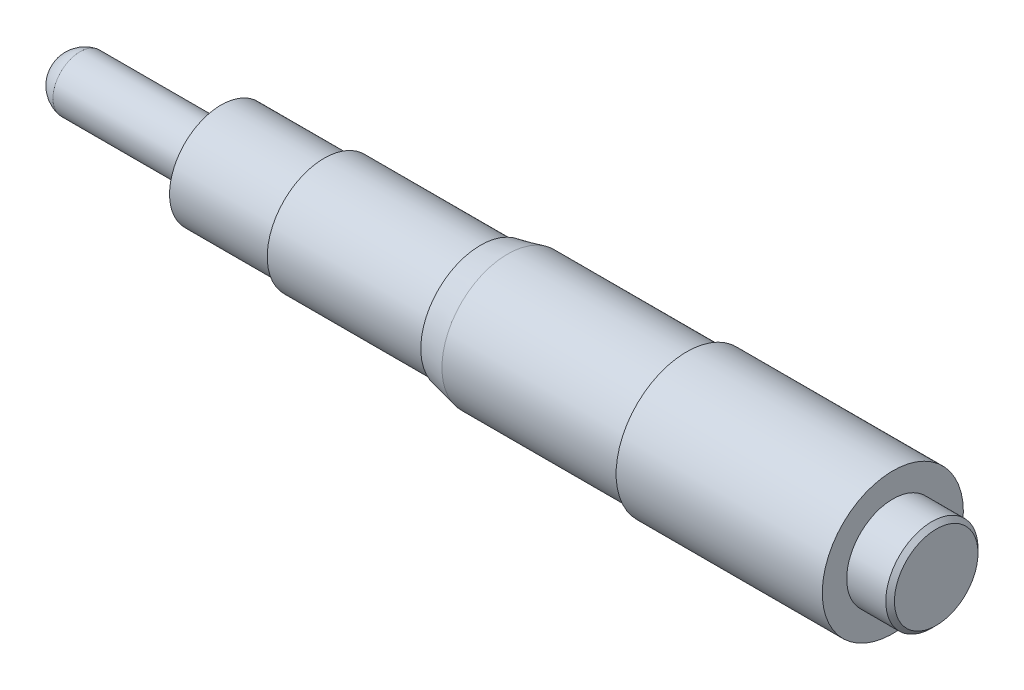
ISO-10303-21;
HEADER;
FILE_DESCRIPTION(('STEP AP214'),'2;1');
FILE_NAME('part.step','',(''),(''),'','','');
FILE_SCHEMA(('AUTOMOTIVE_DESIGN { 1 0 10303 214 1 1 1 1 }'));
ENDSEC;
DATA;
#1=APPLICATION_CONTEXT('core data for automotive mechanical design processes');
#2=APPLICATION_PROTOCOL_DEFINITION('international standard','automotive_design',2000,#1);
#3=PRODUCT_CONTEXT('',#1,'mechanical');
#4=PRODUCT('Part','Part','',(#3));
#5=PRODUCT_RELATED_PRODUCT_CATEGORY('part','',(#4));
#6=PRODUCT_DEFINITION_FORMATION('','',#4);
#7=PRODUCT_DEFINITION_CONTEXT('part definition',#1,'design');
#8=PRODUCT_DEFINITION('design','',#6,#7);
#9=PRODUCT_DEFINITION_SHAPE('','',#8);
#10=(LENGTH_UNIT() NAMED_UNIT(*) SI_UNIT(.MILLI.,.METRE.));
#11=(NAMED_UNIT(*) PLANE_ANGLE_UNIT() SI_UNIT($,.RADIAN.));
#12=(NAMED_UNIT(*) SI_UNIT($,.STERADIAN.) SOLID_ANGLE_UNIT());
#13=UNCERTAINTY_MEASURE_WITH_UNIT(LENGTH_MEASURE(1.E-05),#10,'distance_accuracy_value','');
#14=(GEOMETRIC_REPRESENTATION_CONTEXT(3) GLOBAL_UNCERTAINTY_ASSIGNED_CONTEXT((#13)) GLOBAL_UNIT_ASSIGNED_CONTEXT((#10,
#11,#12)) REPRESENTATION_CONTEXT('',''));
#15=CARTESIAN_POINT('',(0.,0.,0.));
#16=DIRECTION('',(0.,0.,1.));
#17=DIRECTION('',(1.,0.,0.));
#18=AXIS2_PLACEMENT_3D('',#15,#16,#17);
#19=CARTESIAN_POINT('',(-22.0619047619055,6.83589469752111E-13,0.));
#20=DIRECTION('',(1.,0.,0.));
#21=DIRECTION('',(0.,1.,0.));
#22=AXIS2_PLACEMENT_3D('',#19,#20,#21);
#23=SPHERICAL_SURFACE('',#22,2.53809523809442);
#24=CARTESIAN_POINT('',(-22.5,0.,0.));
#25=DIRECTION('',(1.,0.,0.));
#26=DIRECTION('',(0.,0.,-1.));
#27=AXIS2_PLACEMENT_3D('',#24,#25,#26);
#28=CIRCLE('',#27,2.5);
#29=CARTESIAN_POINT('',(-22.5,0.,-2.5));
#30=VERTEX_POINT('',#29);
#31=EDGE_CURVE('E5',#30,#30,#28,.T.);
#32=ORIENTED_EDGE('',*,*,#31,.F.);
#33=EDGE_LOOP('',(#32));
#34=FACE_BOUND('',#33,.T.);
#35=ADVANCED_FACE('F9',(#34),#23,.T.);
#36=CARTESIAN_POINT('',(56.4,0.,0.));
#37=DIRECTION('',(1.,0.,0.));
#38=DIRECTION('',(0.,0.,-1.));
#39=AXIS2_PLACEMENT_3D('',#36,#37,#38);
#40=CYLINDRICAL_SURFACE('',#39,2.5);
#41=CARTESIAN_POINT('',(-9.50000000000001,0.,0.));
#42=DIRECTION('',(1.,0.,0.));
#43=DIRECTION('',(0.,0.,-1.));
#44=AXIS2_PLACEMENT_3D('',#41,#42,#43);
#45=CIRCLE('',#44,2.5);
#46=CARTESIAN_POINT('',(-9.50000000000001,0.,-2.5));
#47=VERTEX_POINT('',#46);
#48=EDGE_CURVE('E20',#47,#47,#45,.T.);
#49=ORIENTED_EDGE('',*,*,#48,.F.);
#50=EDGE_LOOP('',(#49));
#51=FACE_BOUND('',#50,.T.);
#52=ORIENTED_EDGE('',*,*,#31,.T.);
#53=EDGE_LOOP('',(#52));
#54=FACE_BOUND('',#53,.T.);
#55=ADVANCED_FACE('F26',(#51,#54),#40,.T.);
#56=CARTESIAN_POINT('',(-9.5,2.5,0.));
#57=DIRECTION('',(1.,0.,0.));
#58=DIRECTION('',(0.,0.,-1.));
#59=AXIS2_PLACEMENT_3D('',#56,#57,#58);
#60=PLANE('',#59);
#61=CARTESIAN_POINT('',(-9.50000000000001,0.,0.));
#62=DIRECTION('',(1.,0.,0.));
#63=DIRECTION('',(0.,0.,-1.));
#64=AXIS2_PLACEMENT_3D('',#61,#62,#63);
#65=CIRCLE('',#64,4.75);
#66=CARTESIAN_POINT('',(-9.50000000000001,0.,-4.75));
#67=VERTEX_POINT('',#66);
#68=EDGE_CURVE('E33',#67,#67,#65,.T.);
#69=ORIENTED_EDGE('',*,*,#68,.F.);
#70=EDGE_LOOP('',(#69));
#71=FACE_BOUND('',#70,.T.);
#72=ORIENTED_EDGE('',*,*,#48,.T.);
#73=EDGE_LOOP('',(#72));
#74=FACE_BOUND('',#73,.T.);
#75=ADVANCED_FACE('F39',(#71,#74),#60,.F.);
#76=CARTESIAN_POINT('',(56.4,0.,0.));
#77=DIRECTION('',(1.,0.,0.));
#78=DIRECTION('',(0.,0.,-1.));
#79=AXIS2_PLACEMENT_3D('',#76,#77,#78);
#80=CYLINDRICAL_SURFACE('',#79,4.75);
#81=CARTESIAN_POINT('',(0.,0.,0.));
#82=DIRECTION('',(1.,0.,0.));
#83=DIRECTION('',(0.,0.,-1.));
#84=AXIS2_PLACEMENT_3D('',#81,#82,#83);
#85=CIRCLE('',#84,4.75);
#86=CARTESIAN_POINT('',(0.,0.,-4.75));
#87=VERTEX_POINT('',#86);
#88=EDGE_CURVE('E46',#87,#87,#85,.T.);
#89=ORIENTED_EDGE('',*,*,#88,.F.);
#90=EDGE_LOOP('',(#89));
#91=FACE_BOUND('',#90,.T.);
#92=ORIENTED_EDGE('',*,*,#68,.T.);
#93=EDGE_LOOP('',(#92));
#94=FACE_BOUND('',#93,.T.);
#95=ADVANCED_FACE('F52',(#91,#94),#80,.T.);
#96=CARTESIAN_POINT('',(0.,4.75,0.));
#97=DIRECTION('',(1.,0.,0.));
#98=DIRECTION('',(0.,0.,-1.));
#99=AXIS2_PLACEMENT_3D('',#96,#97,#98);
#100=PLANE('',#99);
#101=CARTESIAN_POINT('',(0.,0.,0.));
#102=DIRECTION('',(1.,0.,0.));
#103=DIRECTION('',(0.,0.,-1.));
#104=AXIS2_PLACEMENT_3D('',#101,#102,#103);
#105=CIRCLE('',#104,5.25);
#106=CARTESIAN_POINT('',(0.,0.,-5.25));
#107=VERTEX_POINT('',#106);
#108=EDGE_CURVE('E59',#107,#107,#105,.T.);
#109=ORIENTED_EDGE('',*,*,#108,.F.);
#110=EDGE_LOOP('',(#109));
#111=FACE_BOUND('',#110,.T.);
#112=ORIENTED_EDGE('',*,*,#88,.T.);
#113=EDGE_LOOP('',(#112));
#114=FACE_BOUND('',#113,.T.);
#115=ADVANCED_FACE('F65',(#111,#114),#100,.F.);
#116=CARTESIAN_POINT('',(56.4,0.,0.));
#117=DIRECTION('',(1.,0.,0.));
#118=DIRECTION('',(0.,0.,-1.));
#119=AXIS2_PLACEMENT_3D('',#116,#117,#118);
#120=CYLINDRICAL_SURFACE('',#119,5.25);
#121=CARTESIAN_POINT('',(14.4,0.,0.));
#122=DIRECTION('',(1.,0.,0.));
#123=DIRECTION('',(0.,0.,-1.));
#124=AXIS2_PLACEMENT_3D('',#121,#122,#123);
#125=CIRCLE('',#124,5.25);
#126=CARTESIAN_POINT('',(14.4,0.,-5.25));
#127=VERTEX_POINT('',#126);
#128=EDGE_CURVE('E72',#127,#127,#125,.T.);
#129=ORIENTED_EDGE('',*,*,#128,.F.);
#130=EDGE_LOOP('',(#129));
#131=FACE_BOUND('',#130,.T.);
#132=ORIENTED_EDGE('',*,*,#108,.T.);
#133=EDGE_LOOP('',(#132));
#134=FACE_BOUND('',#133,.T.);
#135=ADVANCED_FACE('F78',(#131,#134),#120,.T.);
#136=CARTESIAN_POINT('',(14.4,5.25,0.));
#137=DIRECTION('',(1.,0.,0.));
#138=DIRECTION('',(0.,0.,-1.));
#139=AXIS2_PLACEMENT_3D('',#136,#137,#138);
#140=PLANE('',#139);
#141=CARTESIAN_POINT('',(14.4,0.,0.));
#142=DIRECTION('',(1.,0.,0.));
#143=DIRECTION('',(0.,0.,-1.));
#144=AXIS2_PLACEMENT_3D('',#141,#142,#143);
#145=CIRCLE('',#144,5.5);
#146=CARTESIAN_POINT('',(14.4,0.,-5.5));
#147=VERTEX_POINT('',#146);
#148=EDGE_CURVE('E85',#147,#147,#145,.T.);
#149=ORIENTED_EDGE('',*,*,#148,.F.);
#150=EDGE_LOOP('',(#149));
#151=FACE_BOUND('',#150,.T.);
#152=ORIENTED_EDGE('',*,*,#128,.T.);
#153=EDGE_LOOP('',(#152));
#154=FACE_BOUND('',#153,.T.);
#155=ADVANCED_FACE('F91',(#151,#154),#140,.F.);
#156=CARTESIAN_POINT('',(14.4,0.,0.));
#157=DIRECTION('',(1.,0.,0.));
#158=DIRECTION('',(0.,0.,-1.));
#159=AXIS2_PLACEMENT_3D('',#156,#157,#158);
#160=CONICAL_SURFACE('',#159,5.5,0.216550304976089);
#161=CARTESIAN_POINT('',(16.9,0.,0.));
#162=DIRECTION('',(1.,0.,0.));
#163=DIRECTION('',(0.,0.,-1.));
#164=AXIS2_PLACEMENT_3D('',#161,#162,#163);
#165=CIRCLE('',#164,6.05);
#166=CARTESIAN_POINT('',(16.9,0.,-6.05));
#167=VERTEX_POINT('',#166);
#168=EDGE_CURVE('E98',#167,#167,#165,.T.);
#169=ORIENTED_EDGE('',*,*,#168,.F.);
#170=EDGE_LOOP('',(#169));
#171=FACE_BOUND('',#170,.T.);
#172=ORIENTED_EDGE('',*,*,#148,.T.);
#173=EDGE_LOOP('',(#172));
#174=FACE_BOUND('',#173,.T.);
#175=ADVANCED_FACE('F104',(#171,#174),#160,.T.);
#176=CARTESIAN_POINT('',(56.4,0.,0.));
#177=DIRECTION('',(1.,0.,0.));
#178=DIRECTION('',(0.,0.,-1.));
#179=AXIS2_PLACEMENT_3D('',#176,#177,#178);
#180=CYLINDRICAL_SURFACE('',#179,6.05);
#181=CARTESIAN_POINT('',(33.4,0.,0.));
#182=DIRECTION('',(1.,0.,0.));
#183=DIRECTION('',(0.,0.,-1.));
#184=AXIS2_PLACEMENT_3D('',#181,#182,#183);
#185=CIRCLE('',#184,6.05);
#186=CARTESIAN_POINT('',(33.4,0.,-6.05));
#187=VERTEX_POINT('',#186);
#188=EDGE_CURVE('E111',#187,#187,#185,.T.);
#189=ORIENTED_EDGE('',*,*,#188,.F.);
#190=EDGE_LOOP('',(#189));
#191=FACE_BOUND('',#190,.T.);
#192=ORIENTED_EDGE('',*,*,#168,.T.);
#193=EDGE_LOOP('',(#192));
#194=FACE_BOUND('',#193,.T.);
#195=ADVANCED_FACE('F117',(#191,#194),#180,.T.);
#196=CARTESIAN_POINT('',(33.4,6.05,0.));
#197=DIRECTION('',(1.,0.,0.));
#198=DIRECTION('',(0.,0.,-1.));
#199=AXIS2_PLACEMENT_3D('',#196,#197,#198);
#200=PLANE('',#199);
#201=CARTESIAN_POINT('',(33.4,0.,0.));
#202=DIRECTION('',(1.,0.,0.));
#203=DIRECTION('',(0.,0.,-1.));
#204=AXIS2_PLACEMENT_3D('',#201,#202,#203);
#205=CIRCLE('',#204,6.5);
#206=CARTESIAN_POINT('',(33.4,0.,-6.5));
#207=VERTEX_POINT('',#206);
#208=EDGE_CURVE('E124',#207,#207,#205,.T.);
#209=ORIENTED_EDGE('',*,*,#208,.F.);
#210=EDGE_LOOP('',(#209));
#211=FACE_BOUND('',#210,.T.);
#212=ORIENTED_EDGE('',*,*,#188,.T.);
#213=EDGE_LOOP('',(#212));
#214=FACE_BOUND('',#213,.T.);
#215=ADVANCED_FACE('F130',(#211,#214),#200,.F.);
#216=CARTESIAN_POINT('',(56.4,0.,0.));
#217=DIRECTION('',(1.,0.,0.));
#218=DIRECTION('',(0.,0.,-1.));
#219=AXIS2_PLACEMENT_3D('',#216,#217,#218);
#220=CYLINDRICAL_SURFACE('',#219,6.5);
#221=CARTESIAN_POINT('',(52.4,0.,0.));
#222=DIRECTION('',(1.,0.,0.));
#223=DIRECTION('',(0.,0.,-1.));
#224=AXIS2_PLACEMENT_3D('',#221,#222,#223);
#225=CIRCLE('',#224,6.5);
#226=CARTESIAN_POINT('',(52.4,0.,-6.5));
#227=VERTEX_POINT('',#226);
#228=EDGE_CURVE('E137',#227,#227,#225,.T.);
#229=ORIENTED_EDGE('',*,*,#228,.F.);
#230=EDGE_LOOP('',(#229));
#231=FACE_BOUND('',#230,.T.);
#232=ORIENTED_EDGE('',*,*,#208,.T.);
#233=EDGE_LOOP('',(#232));
#234=FACE_BOUND('',#233,.T.);
#235=ADVANCED_FACE('F143',(#231,#234),#220,.T.);
#236=CARTESIAN_POINT('',(52.4,6.5,0.));
#237=DIRECTION('',(-1.,0.,0.));
#238=DIRECTION('',(0.,0.,1.));
#239=AXIS2_PLACEMENT_3D('',#236,#237,#238);
#240=PLANE('',#239);
#241=CARTESIAN_POINT('',(52.4,0.,0.));
#242=DIRECTION('',(1.,0.,0.));
#243=DIRECTION('',(0.,0.,-1.));
#244=AXIS2_PLACEMENT_3D('',#241,#242,#243);
#245=CIRCLE('',#244,4.25);
#246=CARTESIAN_POINT('',(52.4,0.,-4.25));
#247=VERTEX_POINT('',#246);
#248=EDGE_CURVE('E150',#247,#247,#245,.T.);
#249=ORIENTED_EDGE('',*,*,#248,.F.);
#250=EDGE_LOOP('',(#249));
#251=FACE_BOUND('',#250,.T.);
#252=ORIENTED_EDGE('',*,*,#228,.T.);
#253=EDGE_LOOP('',(#252));
#254=FACE_BOUND('',#253,.T.);
#255=ADVANCED_FACE('F156',(#251,#254),#240,.F.);
#256=CARTESIAN_POINT('',(56.4,0.,0.));
#257=DIRECTION('',(1.,0.,0.));
#258=DIRECTION('',(0.,0.,-1.));
#259=AXIS2_PLACEMENT_3D('',#256,#257,#258);
#260=CYLINDRICAL_SURFACE('',#259,4.25);
#261=CARTESIAN_POINT('',(56.,0.,0.));
#262=DIRECTION('',(1.,0.,0.));
#263=DIRECTION('',(0.,0.,-1.));
#264=AXIS2_PLACEMENT_3D('',#261,#262,#263);
#265=CIRCLE('',#264,4.25);
#266=CARTESIAN_POINT('',(56.,0.,-4.25));
#267=VERTEX_POINT('',#266);
#268=EDGE_CURVE('E163',#267,#267,#265,.T.);
#269=ORIENTED_EDGE('',*,*,#268,.F.);
#270=EDGE_LOOP('',(#269));
#271=FACE_BOUND('',#270,.T.);
#272=ORIENTED_EDGE('',*,*,#248,.T.);
#273=EDGE_LOOP('',(#272));
#274=FACE_BOUND('',#273,.T.);
#275=ADVANCED_FACE('F169',(#271,#274),#260,.T.);
#276=CARTESIAN_POINT('',(56.,0.,0.));
#277=DIRECTION('',(-1.,0.,0.));
#278=DIRECTION('',(0.,0.,1.));
#279=AXIS2_PLACEMENT_3D('',#276,#277,#278);
#280=CONICAL_SURFACE('',#279,4.25,0.785398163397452);
#281=CARTESIAN_POINT('',(56.4,0.,0.));
#282=DIRECTION('',(1.,0.,0.));
#283=DIRECTION('',(0.,0.,-1.));
#284=AXIS2_PLACEMENT_3D('',#281,#282,#283);
#285=CIRCLE('',#284,3.85);
#286=CARTESIAN_POINT('',(56.4,0.,-3.85));
#287=VERTEX_POINT('',#286);
#288=EDGE_CURVE('E176',#287,#287,#285,.T.);
#289=ORIENTED_EDGE('',*,*,#288,.F.);
#290=EDGE_LOOP('',(#289));
#291=FACE_BOUND('',#290,.T.);
#292=ORIENTED_EDGE('',*,*,#268,.T.);
#293=EDGE_LOOP('',(#292));
#294=FACE_BOUND('',#293,.T.);
#295=ADVANCED_FACE('F182',(#291,#294),#280,.T.);
#296=CARTESIAN_POINT('',(56.4,3.85,0.));
#297=DIRECTION('',(-1.,0.,0.));
#298=DIRECTION('',(0.,0.,1.));
#299=AXIS2_PLACEMENT_3D('',#296,#297,#298);
#300=PLANE('',#299);
#301=ORIENTED_EDGE('',*,*,#288,.T.);
#302=EDGE_LOOP('',(#301));
#303=FACE_BOUND('',#302,.T.);
#304=ADVANCED_FACE('F191',(#303),#300,.F.);
#305=CLOSED_SHELL('',(#35,#55,#75,#95,#115,#135,#155,#175,#195,#215,#235,#255,#275,#295,#304));
#306=MANIFOLD_SOLID_BREP('B1',#305);
#307=ADVANCED_BREP_SHAPE_REPRESENTATION('',(#18,#306),#14);
#308=SHAPE_DEFINITION_REPRESENTATION(#9,#307);
ENDSEC;
END-ISO-10303-21;
